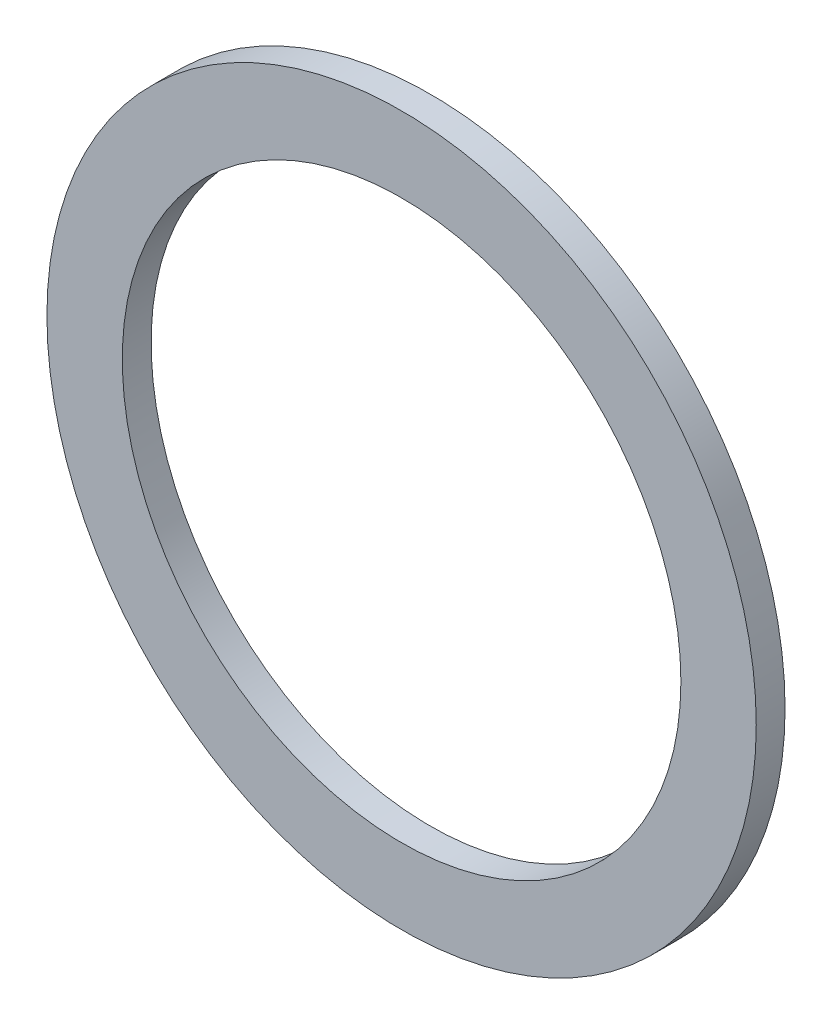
from build123d import *

# Parameters (mm, degrees)
ESQUISSE1_R        = 8
ESQUISSE1_R_2      = 6.3
BOSS_EXTRU_1_DEPTH = 0.65


with BuildPart() as part:
    # Esquisse1 → Boss.-Extru.1 (new body)
    with BuildSketch(Plane.XY):
        Circle(ESQUISSE1_R)
        Circle(ESQUISSE1_R_2, mode=Mode.SUBTRACT)
    extrude(amount=BOSS_EXTRU_1_DEPTH)


solid = part.part
